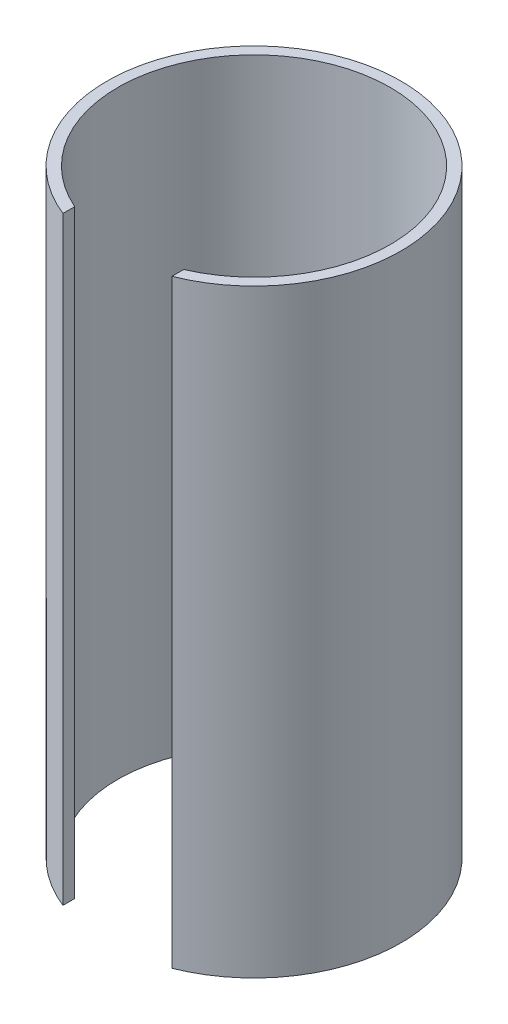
ISO-10303-21;
HEADER;
FILE_DESCRIPTION(('STEP AP214'),'2;1');
FILE_NAME('part.step','',(''),(''),'','','');
FILE_SCHEMA(('AUTOMOTIVE_DESIGN { 1 0 10303 214 1 1 1 1 }'));
ENDSEC;
DATA;
#1=APPLICATION_CONTEXT('core data for automotive mechanical design processes');
#2=APPLICATION_PROTOCOL_DEFINITION('international standard','automotive_design',2000,#1);
#3=PRODUCT_CONTEXT('',#1,'mechanical');
#4=PRODUCT('Part','Part','',(#3));
#5=PRODUCT_RELATED_PRODUCT_CATEGORY('part','',(#4));
#6=PRODUCT_DEFINITION_FORMATION('','',#4);
#7=PRODUCT_DEFINITION_CONTEXT('part definition',#1,'design');
#8=PRODUCT_DEFINITION('design','',#6,#7);
#9=PRODUCT_DEFINITION_SHAPE('','',#8);
#10=(LENGTH_UNIT() NAMED_UNIT(*) SI_UNIT(.MILLI.,.METRE.));
#11=(NAMED_UNIT(*) PLANE_ANGLE_UNIT() SI_UNIT($,.RADIAN.));
#12=(NAMED_UNIT(*) SI_UNIT($,.STERADIAN.) SOLID_ANGLE_UNIT());
#13=UNCERTAINTY_MEASURE_WITH_UNIT(LENGTH_MEASURE(1.E-05),#10,'distance_accuracy_value','');
#14=(GEOMETRIC_REPRESENTATION_CONTEXT(3) GLOBAL_UNCERTAINTY_ASSIGNED_CONTEXT((#13)) GLOBAL_UNIT_ASSIGNED_CONTEXT((#10,
#11,#12)) REPRESENTATION_CONTEXT('',''));
#15=CARTESIAN_POINT('',(0.,0.,0.));
#16=DIRECTION('',(0.,0.,1.));
#17=DIRECTION('',(1.,0.,0.));
#18=AXIS2_PLACEMENT_3D('',#15,#16,#17);
#19=CARTESIAN_POINT('',(0.,55.,0.));
#20=DIRECTION('',(0.,-1.,0.));
#21=DIRECTION('',(0.,0.,-1.));
#22=AXIS2_PLACEMENT_3D('',#19,#20,#21);
#23=CYLINDRICAL_SURFACE('',#22,12.5);
#24=CARTESIAN_POINT('',(0.,0.,0.));
#25=DIRECTION('',(0.,-1.,0.));
#26=DIRECTION('',(0.,0.,1.));
#27=AXIS2_PLACEMENT_3D('',#24,#25,#26);
#28=CIRCLE('',#27,12.5);
#29=CARTESIAN_POINT('',(-5.,0.,11.4564392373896));
#30=VERTEX_POINT('',#29);
#31=CARTESIAN_POINT('',(5.,0.,11.4564392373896));
#32=VERTEX_POINT('',#31);
#33=EDGE_CURVE('E78',#30,#32,#28,.T.);
#34=ORIENTED_EDGE('',*,*,#33,.T.);
#35=DIRECTION('',(0.,-1.,0.));
#36=VECTOR('',#35,1.);
#37=CARTESIAN_POINT('',(5.,55.,11.4564392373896));
#38=LINE('',#37,#36);
#39=CARTESIAN_POINT('',(5.,55.,11.4564392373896));
#40=VERTEX_POINT('',#39);
#41=EDGE_CURVE('E11',#40,#32,#38,.T.);
#42=ORIENTED_EDGE('',*,*,#41,.F.);
#43=CARTESIAN_POINT('',(0.,55.,0.));
#44=DIRECTION('',(0.,-1.,0.));
#45=DIRECTION('',(0.,0.,1.));
#46=AXIS2_PLACEMENT_3D('',#43,#44,#45);
#47=CIRCLE('',#46,12.5);
#48=CARTESIAN_POINT('',(-5.,55.,11.4564392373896));
#49=VERTEX_POINT('',#48);
#50=EDGE_CURVE('E96',#49,#40,#47,.T.);
#51=ORIENTED_EDGE('',*,*,#50,.F.);
#52=DIRECTION('',(0.,-1.,0.));
#53=VECTOR('',#52,1.);
#54=CARTESIAN_POINT('',(-5.,55.,11.4564392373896));
#55=LINE('',#54,#53);
#56=EDGE_CURVE('E90',#49,#30,#55,.T.);
#57=ORIENTED_EDGE('',*,*,#56,.T.);
#58=EDGE_LOOP('',(#34,#42,#51,#57));
#59=FACE_BOUND('',#58,.T.);
#60=ADVANCED_FACE('F34',(#59),#23,.F.);
#61=CARTESIAN_POINT('',(5.,55.,11.4564392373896));
#62=DIRECTION('',(1.,0.,0.));
#63=DIRECTION('',(0.,0.,-1.));
#64=AXIS2_PLACEMENT_3D('',#61,#62,#63);
#65=PLANE('',#64);
#66=DIRECTION('',(0.,0.,1.));
#67=VECTOR('',#66,1.);
#68=CARTESIAN_POINT('',(5.,0.,11.4564392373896));
#69=LINE('',#68,#67);
#70=CARTESIAN_POINT('',(5.,0.,12.5399362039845));
#71=VERTEX_POINT('',#70);
#72=EDGE_CURVE('E74',#32,#71,#69,.T.);
#73=ORIENTED_EDGE('',*,*,#72,.T.);
#74=DIRECTION('',(0.,-1.,0.));
#75=VECTOR('',#74,1.);
#76=CARTESIAN_POINT('',(5.,55.,12.5399362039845));
#77=LINE('',#76,#75);
#78=CARTESIAN_POINT('',(5.,55.,12.5399362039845));
#79=VERTEX_POINT('',#78);
#80=EDGE_CURVE('E41',#79,#71,#77,.T.);
#81=ORIENTED_EDGE('',*,*,#80,.F.);
#82=DIRECTION('',(0.,0.,1.));
#83=VECTOR('',#82,1.);
#84=CARTESIAN_POINT('',(5.,55.,11.4564392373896));
#85=LINE('',#84,#83);
#86=EDGE_CURVE('E86',#40,#79,#85,.T.);
#87=ORIENTED_EDGE('',*,*,#86,.F.);
#88=ORIENTED_EDGE('',*,*,#41,.T.);
#89=EDGE_LOOP('',(#73,#81,#87,#88));
#90=FACE_BOUND('',#89,.T.);
#91=ADVANCED_FACE('F85',(#90),#65,.F.);
#92=CARTESIAN_POINT('',(0.,55.,0.));
#93=DIRECTION('',(0.,-1.,0.));
#94=DIRECTION('',(0.,0.,-1.));
#95=AXIS2_PLACEMENT_3D('',#92,#93,#94);
#96=CYLINDRICAL_SURFACE('',#95,13.5);
#97=CARTESIAN_POINT('',(0.,0.,0.));
#98=DIRECTION('',(0.,1.,0.));
#99=DIRECTION('',(0.,0.,1.));
#100=AXIS2_PLACEMENT_3D('',#97,#98,#99);
#101=CIRCLE('',#100,13.5);
#102=CARTESIAN_POINT('',(-5.00000000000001,0.,12.5399362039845));
#103=VERTEX_POINT('',#102);
#104=EDGE_CURVE('E79',#71,#103,#101,.T.);
#105=ORIENTED_EDGE('',*,*,#104,.T.);
#106=DIRECTION('',(0.,-1.,0.));
#107=VECTOR('',#106,1.);
#108=CARTESIAN_POINT('',(-5.00000000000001,55.,12.5399362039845));
#109=LINE('',#108,#107);
#110=CARTESIAN_POINT('',(-5.00000000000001,55.,12.5399362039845));
#111=VERTEX_POINT('',#110);
#112=EDGE_CURVE('E102',#111,#103,#109,.T.);
#113=ORIENTED_EDGE('',*,*,#112,.F.);
#114=CARTESIAN_POINT('',(0.,55.,0.));
#115=DIRECTION('',(0.,1.,0.));
#116=DIRECTION('',(0.,0.,1.));
#117=AXIS2_PLACEMENT_3D('',#114,#115,#116);
#118=CIRCLE('',#117,13.5);
#119=EDGE_CURVE('E53',#79,#111,#118,.T.);
#120=ORIENTED_EDGE('',*,*,#119,.F.);
#121=ORIENTED_EDGE('',*,*,#80,.T.);
#122=EDGE_LOOP('',(#105,#113,#120,#121));
#123=FACE_BOUND('',#122,.T.);
#124=ADVANCED_FACE('F105',(#123),#96,.T.);
#125=CARTESIAN_POINT('',(-5.,55.,11.4564392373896));
#126=DIRECTION('',(-1.,0.,0.));
#127=DIRECTION('',(0.,0.,1.));
#128=AXIS2_PLACEMENT_3D('',#125,#126,#127);
#129=PLANE('',#128);
#130=DIRECTION('',(0.,0.,-1.));
#131=VECTOR('',#130,1.);
#132=CARTESIAN_POINT('',(-5.,0.,11.4564392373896));
#133=LINE('',#132,#131);
#134=EDGE_CURVE('E94',#103,#30,#133,.T.);
#135=ORIENTED_EDGE('',*,*,#134,.T.);
#136=ORIENTED_EDGE('',*,*,#56,.F.);
#137=DIRECTION('',(0.,0.,-1.));
#138=VECTOR('',#137,1.);
#139=CARTESIAN_POINT('',(-5.,55.,11.4564392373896));
#140=LINE('',#139,#138);
#141=EDGE_CURVE('E48',#111,#49,#140,.T.);
#142=ORIENTED_EDGE('',*,*,#141,.F.);
#143=ORIENTED_EDGE('',*,*,#112,.T.);
#144=EDGE_LOOP('',(#135,#136,#142,#143));
#145=FACE_BOUND('',#144,.T.);
#146=ADVANCED_FACE('F107',(#145),#129,.F.);
#147=CARTESIAN_POINT('',(0.,55.,0.));
#148=DIRECTION('',(0.,1.,0.));
#149=DIRECTION('',(0.,0.,1.));
#150=AXIS2_PLACEMENT_3D('',#147,#148,#149);
#151=PLANE('',#150);
#152=ORIENTED_EDGE('',*,*,#50,.T.);
#153=ORIENTED_EDGE('',*,*,#86,.T.);
#154=ORIENTED_EDGE('',*,*,#119,.T.);
#155=ORIENTED_EDGE('',*,*,#141,.T.);
#156=EDGE_LOOP('',(#152,#153,#154,#155));
#157=FACE_BOUND('',#156,.T.);
#158=ADVANCED_FACE('F108',(#157),#151,.T.);
#159=CARTESIAN_POINT('',(0.,0.,0.));
#160=DIRECTION('',(0.,1.,0.));
#161=DIRECTION('',(0.,0.,1.));
#162=AXIS2_PLACEMENT_3D('',#159,#160,#161);
#163=PLANE('',#162);
#164=ORIENTED_EDGE('',*,*,#33,.F.);
#165=ORIENTED_EDGE('',*,*,#134,.F.);
#166=ORIENTED_EDGE('',*,*,#104,.F.);
#167=ORIENTED_EDGE('',*,*,#72,.F.);
#168=EDGE_LOOP('',(#164,#165,#166,#167));
#169=FACE_BOUND('',#168,.T.);
#170=ADVANCED_FACE('F75',(#169),#163,.F.);
#171=CLOSED_SHELL('',(#60,#91,#124,#146,#158,#170));
#172=MANIFOLD_SOLID_BREP('B2',#171);
#173=ADVANCED_BREP_SHAPE_REPRESENTATION('',(#18,#172),#14);
#174=SHAPE_DEFINITION_REPRESENTATION(#9,#173);
ENDSEC;
END-ISO-10303-21;
